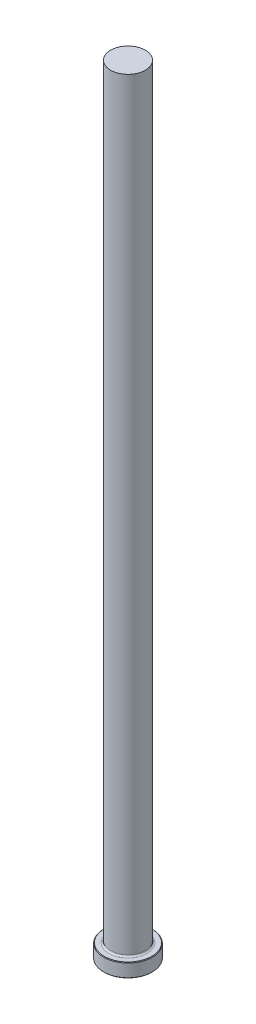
ISO-10303-21;
HEADER;
FILE_DESCRIPTION(('STEP AP214'),'2;1');
FILE_NAME('part.step','',(''),(''),'','','');
FILE_SCHEMA(('AUTOMOTIVE_DESIGN { 1 0 10303 214 1 1 1 1 }'));
ENDSEC;
DATA;
#1=APPLICATION_CONTEXT('core data for automotive mechanical design processes');
#2=APPLICATION_PROTOCOL_DEFINITION('international standard','automotive_design',2000,#1);
#3=PRODUCT_CONTEXT('',#1,'mechanical');
#4=PRODUCT('Part','Part','',(#3));
#5=PRODUCT_RELATED_PRODUCT_CATEGORY('part','',(#4));
#6=PRODUCT_DEFINITION_FORMATION('','',#4);
#7=PRODUCT_DEFINITION_CONTEXT('part definition',#1,'design');
#8=PRODUCT_DEFINITION('design','',#6,#7);
#9=PRODUCT_DEFINITION_SHAPE('','',#8);
#10=(LENGTH_UNIT() NAMED_UNIT(*) SI_UNIT(.MILLI.,.METRE.));
#11=(NAMED_UNIT(*) PLANE_ANGLE_UNIT() SI_UNIT($,.RADIAN.));
#12=(NAMED_UNIT(*) SI_UNIT($,.STERADIAN.) SOLID_ANGLE_UNIT());
#13=UNCERTAINTY_MEASURE_WITH_UNIT(LENGTH_MEASURE(1.E-05),#10,'distance_accuracy_value','');
#14=(GEOMETRIC_REPRESENTATION_CONTEXT(3) GLOBAL_UNCERTAINTY_ASSIGNED_CONTEXT((#13)) GLOBAL_UNIT_ASSIGNED_CONTEXT((#10,
#11,#12)) REPRESENTATION_CONTEXT('',''));
#15=CARTESIAN_POINT('',(0.,0.,0.));
#16=DIRECTION('',(0.,0.,1.));
#17=DIRECTION('',(1.,0.,0.));
#18=AXIS2_PLACEMENT_3D('',#15,#16,#17);
#19=CARTESIAN_POINT('',(0.,0.,0.));
#20=DIRECTION('',(0.,-1.,0.));
#21=DIRECTION('',(0.,0.,-1.));
#22=AXIS2_PLACEMENT_3D('',#19,#20,#21);
#23=PLANE('',#22);
#24=CARTESIAN_POINT('',(0.,0.,0.));
#25=DIRECTION('',(0.,-1.,0.));
#26=DIRECTION('',(0.,0.,-1.));
#27=AXIS2_PLACEMENT_3D('',#24,#25,#26);
#28=CIRCLE('',#27,10.8585);
#29=CARTESIAN_POINT('',(0.,0.,-10.8585));
#30=VERTEX_POINT('',#29);
#31=EDGE_CURVE('E46',#30,#30,#28,.T.);
#32=ORIENTED_EDGE('',*,*,#31,.T.);
#33=EDGE_LOOP('',(#32));
#34=FACE_BOUND('',#33,.T.);
#35=ADVANCED_FACE('F35',(#34),#23,.T.);
#36=CARTESIAN_POINT('',(0.,259.958771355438,0.));
#37=DIRECTION('',(0.,1.,0.));
#38=DIRECTION('',(0.,0.,1.));
#39=AXIS2_PLACEMENT_3D('',#36,#37,#38);
#40=CYLINDRICAL_SURFACE('',#39,11.1125);
#41=CARTESIAN_POINT('',(0.,6.09599999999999,0.));
#42=DIRECTION('',(0.,1.,0.));
#43=DIRECTION('',(0.,0.,1.));
#44=AXIS2_PLACEMENT_3D('',#41,#42,#43);
#45=CIRCLE('',#44,11.1125);
#46=CARTESIAN_POINT('',(0.,6.09599999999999,11.1125));
#47=VERTEX_POINT('',#46);
#48=EDGE_CURVE('E50',#47,#47,#45,.F.);
#49=ORIENTED_EDGE('',*,*,#48,.T.);
#50=EDGE_LOOP('',(#49));
#51=FACE_BOUND('',#50,.T.);
#52=CARTESIAN_POINT('',(0.,0.253999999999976,0.));
#53=DIRECTION('',(0.,-1.,0.));
#54=DIRECTION('',(0.,0.,-1.));
#55=AXIS2_PLACEMENT_3D('',#52,#53,#54);
#56=CIRCLE('',#55,11.1125);
#57=CARTESIAN_POINT('',(0.,0.253999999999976,-11.1125));
#58=VERTEX_POINT('',#57);
#59=EDGE_CURVE('E55',#58,#58,#56,.F.);
#60=ORIENTED_EDGE('',*,*,#59,.T.);
#61=EDGE_LOOP('',(#60));
#62=FACE_BOUND('',#61,.T.);
#63=ADVANCED_FACE('F77',(#51,#62),#40,.T.);
#64=CARTESIAN_POINT('',(-11.1125,6.35,0.));
#65=DIRECTION('',(0.,1.,0.));
#66=DIRECTION('',(0.,0.,1.));
#67=AXIS2_PLACEMENT_3D('',#64,#65,#66);
#68=PLANE('',#67);
#69=CARTESIAN_POINT('',(0.,6.35,0.));
#70=DIRECTION('',(0.,1.,0.));
#71=DIRECTION('',(0.,0.,1.));
#72=AXIS2_PLACEMENT_3D('',#69,#70,#71);
#73=CIRCLE('',#72,8.69949999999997);
#74=CARTESIAN_POINT('',(0.,6.35,8.69949999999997));
#75=VERTEX_POINT('',#74);
#76=EDGE_CURVE('E10',#75,#75,#73,.F.);
#77=ORIENTED_EDGE('',*,*,#76,.T.);
#78=EDGE_LOOP('',(#77));
#79=FACE_BOUND('',#78,.T.);
#80=CARTESIAN_POINT('',(0.,6.35,0.));
#81=DIRECTION('',(0.,1.,0.));
#82=DIRECTION('',(0.,0.,1.));
#83=AXIS2_PLACEMENT_3D('',#80,#81,#82);
#84=CIRCLE('',#83,10.8585);
#85=CARTESIAN_POINT('',(0.,6.35,10.8585));
#86=VERTEX_POINT('',#85);
#87=EDGE_CURVE('E58',#86,#86,#84,.T.);
#88=ORIENTED_EDGE('',*,*,#87,.T.);
#89=EDGE_LOOP('',(#88));
#90=FACE_BOUND('',#89,.T.);
#91=ADVANCED_FACE('F69',(#79,#90),#68,.T.);
#92=CARTESIAN_POINT('',(0.,259.958771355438,0.));
#93=DIRECTION('',(0.,1.,0.));
#94=DIRECTION('',(0.,0.,1.));
#95=AXIS2_PLACEMENT_3D('',#92,#93,#94);
#96=CYLINDRICAL_SURFACE('',#95,7.93749999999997);
#97=CARTESIAN_POINT('',(0.,7.11200000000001,0.));
#98=DIRECTION('',(0.,1.,0.));
#99=DIRECTION('',(0.,0.,1.));
#100=AXIS2_PLACEMENT_3D('',#97,#98,#99);
#101=CIRCLE('',#100,7.93749999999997);
#102=CARTESIAN_POINT('',(0.,7.11200000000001,7.93749999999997));
#103=VERTEX_POINT('',#102);
#104=EDGE_CURVE('E42',#103,#103,#101,.T.);
#105=ORIENTED_EDGE('',*,*,#104,.T.);
#106=EDGE_LOOP('',(#105));
#107=FACE_BOUND('',#106,.T.);
#108=CARTESIAN_POINT('',(0.,355.6,0.));
#109=DIRECTION('',(0.,1.,0.));
#110=DIRECTION('',(0.,0.,1.));
#111=AXIS2_PLACEMENT_3D('',#108,#109,#110);
#112=CIRCLE('',#111,7.93749999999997);
#113=CARTESIAN_POINT('',(0.,355.6,7.93749999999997));
#114=VERTEX_POINT('',#113);
#115=EDGE_CURVE('E61',#114,#114,#112,.T.);
#116=ORIENTED_EDGE('',*,*,#115,.F.);
#117=EDGE_LOOP('',(#116));
#118=FACE_BOUND('',#117,.T.);
#119=ADVANCED_FACE('F67',(#107,#118),#96,.T.);
#120=CARTESIAN_POINT('',(-7.93749999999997,355.6,0.));
#121=DIRECTION('',(0.,1.,0.));
#122=DIRECTION('',(0.,0.,1.));
#123=AXIS2_PLACEMENT_3D('',#120,#121,#122);
#124=PLANE('',#123);
#125=ORIENTED_EDGE('',*,*,#115,.T.);
#126=EDGE_LOOP('',(#125));
#127=FACE_BOUND('',#126,.T.);
#128=ADVANCED_FACE('F65',(#127),#124,.T.);
#129=CARTESIAN_POINT('',(0.,6.35000000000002,0.));
#130=DIRECTION('',(0.,-1.,0.));
#131=DIRECTION('',(0.,0.,-1.));
#132=AXIS2_PLACEMENT_3D('',#129,#130,#131);
#133=CONICAL_SURFACE('',#132,10.8584999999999,0.785398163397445);
#134=ORIENTED_EDGE('',*,*,#48,.F.);
#135=EDGE_LOOP('',(#134));
#136=FACE_BOUND('',#135,.T.);
#137=ORIENTED_EDGE('',*,*,#87,.F.);
#138=EDGE_LOOP('',(#137));
#139=FACE_BOUND('',#138,.T.);
#140=ADVANCED_FACE('F75',(#136,#139),#133,.T.);
#141=CARTESIAN_POINT('',(0.,0.253999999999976,0.));
#142=DIRECTION('',(0.,1.,0.));
#143=DIRECTION('',(0.,0.,1.));
#144=AXIS2_PLACEMENT_3D('',#141,#142,#143);
#145=CONICAL_SURFACE('',#144,11.1125,0.78539816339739);
#146=ORIENTED_EDGE('',*,*,#31,.F.);
#147=EDGE_LOOP('',(#146));
#148=FACE_BOUND('',#147,.T.);
#149=ORIENTED_EDGE('',*,*,#59,.F.);
#150=EDGE_LOOP('',(#149));
#151=FACE_BOUND('',#150,.T.);
#152=ADVANCED_FACE('F89',(#148,#151),#145,.T.);
#153=CARTESIAN_POINT('',(0.,7.11200000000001,0.));
#154=DIRECTION('',(0.,1.,0.));
#155=DIRECTION('',(0.,0.,1.));
#156=AXIS2_PLACEMENT_3D('',#153,#154,#155);
#157=TOROIDAL_SURFACE('',#156,8.69949999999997,0.762);
#158=ORIENTED_EDGE('',*,*,#76,.F.);
#159=EDGE_LOOP('',(#158));
#160=FACE_BOUND('',#159,.T.);
#161=ORIENTED_EDGE('',*,*,#104,.F.);
#162=EDGE_LOOP('',(#161));
#163=FACE_BOUND('',#162,.T.);
#164=ADVANCED_FACE('F37',(#160,#163),#157,.F.);
#165=CLOSED_SHELL('',(#35,#63,#91,#119,#128,#140,#152,#164));
#166=MANIFOLD_SOLID_BREP('B2',#165);
#167=ADVANCED_BREP_SHAPE_REPRESENTATION('',(#18,#166),#14);
#168=SHAPE_DEFINITION_REPRESENTATION(#9,#167);
ENDSEC;
END-ISO-10303-21;
